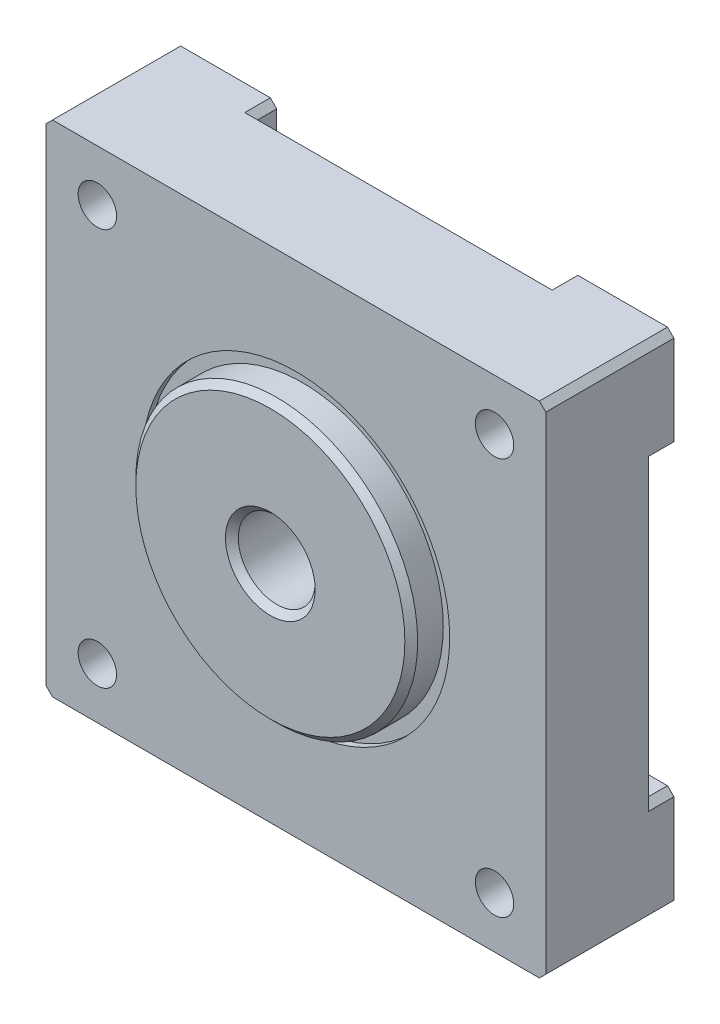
ISO-10303-21;
HEADER;
FILE_DESCRIPTION(('STEP AP214'),'2;1');
FILE_NAME('part.step','',(''),(''),'','','');
FILE_SCHEMA(('AUTOMOTIVE_DESIGN { 1 0 10303 214 1 1 1 1 }'));
ENDSEC;
DATA;
#1=APPLICATION_CONTEXT('core data for automotive mechanical design processes');
#2=APPLICATION_PROTOCOL_DEFINITION('international standard','automotive_design',2000,#1);
#3=PRODUCT_CONTEXT('',#1,'mechanical');
#4=PRODUCT('Part','Part','',(#3));
#5=PRODUCT_RELATED_PRODUCT_CATEGORY('part','',(#4));
#6=PRODUCT_DEFINITION_FORMATION('','',#4);
#7=PRODUCT_DEFINITION_CONTEXT('part definition',#1,'design');
#8=PRODUCT_DEFINITION('design','',#6,#7);
#9=PRODUCT_DEFINITION_SHAPE('','',#8);
#10=(LENGTH_UNIT() NAMED_UNIT(*) SI_UNIT(.MILLI.,.METRE.));
#11=(NAMED_UNIT(*) PLANE_ANGLE_UNIT() SI_UNIT($,.RADIAN.));
#12=(NAMED_UNIT(*) SI_UNIT($,.STERADIAN.) SOLID_ANGLE_UNIT());
#13=UNCERTAINTY_MEASURE_WITH_UNIT(LENGTH_MEASURE(1.E-05),#10,'distance_accuracy_value','');
#14=(GEOMETRIC_REPRESENTATION_CONTEXT(3) GLOBAL_UNCERTAINTY_ASSIGNED_CONTEXT((#13)) GLOBAL_UNIT_ASSIGNED_CONTEXT((#10,
#11,#12)) REPRESENTATION_CONTEXT('',''));
#15=CARTESIAN_POINT('',(0.,0.,0.));
#16=DIRECTION('',(0.,0.,1.));
#17=DIRECTION('',(1.,0.,0.));
#18=AXIS2_PLACEMENT_3D('',#15,#16,#17);
#19=CARTESIAN_POINT('',(19.,19.5,10.));
#20=DIRECTION('',(0.,-1.,0.));
#21=DIRECTION('',(1.,0.,0.));
#22=AXIS2_PLACEMENT_3D('',#19,#20,#21);
#23=PLANE('',#22);
#24=DIRECTION('',(1.,0.,0.));
#25=VECTOR('',#24,1.);
#26=CARTESIAN_POINT('',(0.,19.5,2.));
#27=LINE('',#26,#25);
#28=CARTESIAN_POINT('',(-12.,19.5,2.));
#29=VERTEX_POINT('',#28);
#30=CARTESIAN_POINT('',(12.,19.5,2.));
#31=VERTEX_POINT('',#30);
#32=EDGE_CURVE('E657',#29,#31,#27,.T.);
#33=ORIENTED_EDGE('',*,*,#32,.F.);
#34=DIRECTION('',(0.,0.,-1.));
#35=VECTOR('',#34,1.);
#36=CARTESIAN_POINT('',(-12.,19.5,10.));
#37=LINE('',#36,#35);
#38=CARTESIAN_POINT('',(-12.,19.5,0.));
#39=VERTEX_POINT('',#38);
#40=EDGE_CURVE('E345',#29,#39,#37,.T.);
#41=ORIENTED_EDGE('',*,*,#40,.T.);
#42=DIRECTION('',(-1.,0.,0.));
#43=VECTOR('',#42,1.);
#44=CARTESIAN_POINT('',(19.,19.5,0.));
#45=LINE('',#44,#43);
#46=CARTESIAN_POINT('',(-19.,19.5,0.));
#47=VERTEX_POINT('',#46);
#48=EDGE_CURVE('E269',#39,#47,#45,.T.);
#49=ORIENTED_EDGE('',*,*,#48,.T.);
#50=DIRECTION('',(0.,0.,-1.));
#51=VECTOR('',#50,1.);
#52=CARTESIAN_POINT('',(-19.,19.5,10.));
#53=LINE('',#52,#51);
#54=CARTESIAN_POINT('',(-19.,19.5,10.));
#55=VERTEX_POINT('',#54);
#56=EDGE_CURVE('E250',#55,#47,#53,.T.);
#57=ORIENTED_EDGE('',*,*,#56,.F.);
#58=DIRECTION('',(-1.,0.,0.));
#59=VECTOR('',#58,1.);
#60=CARTESIAN_POINT('',(19.,19.5,10.));
#61=LINE('',#60,#59);
#62=CARTESIAN_POINT('',(19.,19.5,10.));
#63=VERTEX_POINT('',#62);
#64=EDGE_CURVE('E256',#63,#55,#61,.T.);
#65=ORIENTED_EDGE('',*,*,#64,.F.);
#66=DIRECTION('',(0.,0.,-1.));
#67=VECTOR('',#66,1.);
#68=CARTESIAN_POINT('',(19.,19.5,10.));
#69=LINE('',#68,#67);
#70=CARTESIAN_POINT('',(19.,19.5,0.));
#71=VERTEX_POINT('',#70);
#72=EDGE_CURVE('E582',#63,#71,#69,.T.);
#73=ORIENTED_EDGE('',*,*,#72,.T.);
#74=CARTESIAN_POINT('',(12.,19.5,0.));
#75=VERTEX_POINT('',#74);
#76=EDGE_CURVE('E583',#71,#75,#45,.T.);
#77=ORIENTED_EDGE('',*,*,#76,.T.);
#78=DIRECTION('',(0.,0.,1.));
#79=VECTOR('',#78,1.);
#80=CARTESIAN_POINT('',(12.,19.5,2.));
#81=LINE('',#80,#79);
#82=EDGE_CURVE('E342',#75,#31,#81,.T.);
#83=ORIENTED_EDGE('',*,*,#82,.T.);
#84=EDGE_LOOP('',(#33,#41,#49,#57,#65,#73,#77,#83));
#85=FACE_BOUND('',#84,.T.);
#86=ADVANCED_FACE('F35',(#85),#23,.F.);
#87=CARTESIAN_POINT('',(-19.5,19.,10.));
#88=DIRECTION('',(1.,0.,0.));
#89=DIRECTION('',(0.,1.,0.));
#90=AXIS2_PLACEMENT_3D('',#87,#88,#89);
#91=PLANE('',#90);
#92=DIRECTION('',(0.,1.,0.));
#93=VECTOR('',#92,1.);
#94=CARTESIAN_POINT('',(-19.5,0.,2.));
#95=LINE('',#94,#93);
#96=CARTESIAN_POINT('',(-19.5,-12.,2.));
#97=VERTEX_POINT('',#96);
#98=CARTESIAN_POINT('',(-19.5,12.,2.));
#99=VERTEX_POINT('',#98);
#100=EDGE_CURVE('E645',#97,#99,#95,.T.);
#101=ORIENTED_EDGE('',*,*,#100,.F.);
#102=DIRECTION('',(0.,0.,-1.));
#103=VECTOR('',#102,1.);
#104=CARTESIAN_POINT('',(-19.5,-12.,10.));
#105=LINE('',#104,#103);
#106=CARTESIAN_POINT('',(-19.5,-12.,0.));
#107=VERTEX_POINT('',#106);
#108=EDGE_CURVE('E274',#97,#107,#105,.T.);
#109=ORIENTED_EDGE('',*,*,#108,.T.);
#110=DIRECTION('',(0.,-1.,0.));
#111=VECTOR('',#110,1.);
#112=CARTESIAN_POINT('',(-19.5,19.,0.));
#113=LINE('',#112,#111);
#114=CARTESIAN_POINT('',(-19.5,-19.,0.));
#115=VERTEX_POINT('',#114);
#116=EDGE_CURVE('E588',#107,#115,#113,.T.);
#117=ORIENTED_EDGE('',*,*,#116,.T.);
#118=DIRECTION('',(0.,0.,-1.));
#119=VECTOR('',#118,1.);
#120=CARTESIAN_POINT('',(-19.5,-19.,10.));
#121=LINE('',#120,#119);
#122=CARTESIAN_POINT('',(-19.5,-19.,10.));
#123=VERTEX_POINT('',#122);
#124=EDGE_CURVE('E276',#123,#115,#121,.T.);
#125=ORIENTED_EDGE('',*,*,#124,.F.);
#126=DIRECTION('',(0.,-1.,0.));
#127=VECTOR('',#126,1.);
#128=CARTESIAN_POINT('',(-19.5,19.,10.));
#129=LINE('',#128,#127);
#130=CARTESIAN_POINT('',(-19.5,19.,10.));
#131=VERTEX_POINT('',#130);
#132=EDGE_CURVE('E255',#131,#123,#129,.T.);
#133=ORIENTED_EDGE('',*,*,#132,.F.);
#134=DIRECTION('',(0.,0.,-1.));
#135=VECTOR('',#134,1.);
#136=CARTESIAN_POINT('',(-19.5,19.,10.));
#137=LINE('',#136,#135);
#138=CARTESIAN_POINT('',(-19.5,19.,0.));
#139=VERTEX_POINT('',#138);
#140=EDGE_CURVE('E252',#131,#139,#137,.T.);
#141=ORIENTED_EDGE('',*,*,#140,.T.);
#142=CARTESIAN_POINT('',(-19.5,12.,0.));
#143=VERTEX_POINT('',#142);
#144=EDGE_CURVE('E589',#139,#143,#113,.T.);
#145=ORIENTED_EDGE('',*,*,#144,.T.);
#146=DIRECTION('',(0.,0.,1.));
#147=VECTOR('',#146,1.);
#148=CARTESIAN_POINT('',(-19.5,12.,2.));
#149=LINE('',#148,#147);
#150=EDGE_CURVE('E271',#143,#99,#149,.T.);
#151=ORIENTED_EDGE('',*,*,#150,.T.);
#152=EDGE_LOOP('',(#101,#109,#117,#125,#133,#141,#145,#151));
#153=FACE_BOUND('',#152,.T.);
#154=ADVANCED_FACE('F416',(#153),#91,.F.);
#155=CARTESIAN_POINT('',(19.,-19.5,10.));
#156=DIRECTION('',(0.,1.,0.));
#157=DIRECTION('',(-1.,0.,0.));
#158=AXIS2_PLACEMENT_3D('',#155,#156,#157);
#159=PLANE('',#158);
#160=DIRECTION('',(1.,0.,0.));
#161=VECTOR('',#160,1.);
#162=CARTESIAN_POINT('',(19.,-19.5,0.));
#163=LINE('',#162,#161);
#164=CARTESIAN_POINT('',(-19.,-19.5,0.));
#165=VERTEX_POINT('',#164);
#166=CARTESIAN_POINT('',(-12.,-19.5,0.));
#167=VERTEX_POINT('',#166);
#168=EDGE_CURVE('E595',#165,#167,#163,.T.);
#169=ORIENTED_EDGE('',*,*,#168,.T.);
#170=DIRECTION('',(0.,0.,1.));
#171=VECTOR('',#170,1.);
#172=CARTESIAN_POINT('',(-12.,-19.5,2.));
#173=LINE('',#172,#171);
#174=CARTESIAN_POINT('',(-12.,-19.5,2.));
#175=VERTEX_POINT('',#174);
#176=EDGE_CURVE('E301',#167,#175,#173,.T.);
#177=ORIENTED_EDGE('',*,*,#176,.T.);
#178=DIRECTION('',(-1.,0.,0.));
#179=VECTOR('',#178,1.);
#180=CARTESIAN_POINT('',(0.,-19.5,2.));
#181=LINE('',#180,#179);
#182=CARTESIAN_POINT('',(12.,-19.5,2.));
#183=VERTEX_POINT('',#182);
#184=EDGE_CURVE('E637',#183,#175,#181,.T.);
#185=ORIENTED_EDGE('',*,*,#184,.F.);
#186=DIRECTION('',(0.,0.,-1.));
#187=VECTOR('',#186,1.);
#188=CARTESIAN_POINT('',(12.,-19.5,10.));
#189=LINE('',#188,#187);
#190=CARTESIAN_POINT('',(12.,-19.5,0.));
#191=VERTEX_POINT('',#190);
#192=EDGE_CURVE('E298',#183,#191,#189,.T.);
#193=ORIENTED_EDGE('',*,*,#192,.T.);
#194=CARTESIAN_POINT('',(19.,-19.5,0.));
#195=VERTEX_POINT('',#194);
#196=EDGE_CURVE('E594',#191,#195,#163,.T.);
#197=ORIENTED_EDGE('',*,*,#196,.T.);
#198=DIRECTION('',(0.,0.,-1.));
#199=VECTOR('',#198,1.);
#200=CARTESIAN_POINT('',(19.,-19.5,10.));
#201=LINE('',#200,#199);
#202=CARTESIAN_POINT('',(19.,-19.5,10.));
#203=VERTEX_POINT('',#202);
#204=EDGE_CURVE('E612',#203,#195,#201,.T.);
#205=ORIENTED_EDGE('',*,*,#204,.F.);
#206=DIRECTION('',(1.,0.,0.));
#207=VECTOR('',#206,1.);
#208=CARTESIAN_POINT('',(19.,-19.5,10.));
#209=LINE('',#208,#207);
#210=CARTESIAN_POINT('',(-19.,-19.5,10.));
#211=VERTEX_POINT('',#210);
#212=EDGE_CURVE('E575',#211,#203,#209,.T.);
#213=ORIENTED_EDGE('',*,*,#212,.F.);
#214=DIRECTION('',(0.,0.,-1.));
#215=VECTOR('',#214,1.);
#216=CARTESIAN_POINT('',(-19.,-19.5,10.));
#217=LINE('',#216,#215);
#218=EDGE_CURVE('E615',#211,#165,#217,.T.);
#219=ORIENTED_EDGE('',*,*,#218,.T.);
#220=EDGE_LOOP('',(#169,#177,#185,#193,#197,#205,#213,#219));
#221=FACE_BOUND('',#220,.T.);
#222=ADVANCED_FACE('F421',(#221),#159,.F.);
#223=CARTESIAN_POINT('',(19.5,19.,10.));
#224=DIRECTION('',(-1.,0.,0.));
#225=DIRECTION('',(0.,0.,1.));
#226=AXIS2_PLACEMENT_3D('',#223,#224,#225);
#227=PLANE('',#226);
#228=DIRECTION('',(0.,1.,0.));
#229=VECTOR('',#228,1.);
#230=CARTESIAN_POINT('',(19.5,19.,0.));
#231=LINE('',#230,#229);
#232=CARTESIAN_POINT('',(19.5,-19.,0.));
#233=VERTEX_POINT('',#232);
#234=CARTESIAN_POINT('',(19.5,-12.,0.));
#235=VERTEX_POINT('',#234);
#236=EDGE_CURVE('E601',#233,#235,#231,.T.);
#237=ORIENTED_EDGE('',*,*,#236,.T.);
#238=DIRECTION('',(0.,0.,1.));
#239=VECTOR('',#238,1.);
#240=CARTESIAN_POINT('',(19.5,-12.,2.));
#241=LINE('',#240,#239);
#242=CARTESIAN_POINT('',(19.5,-12.,2.));
#243=VERTEX_POINT('',#242);
#244=EDGE_CURVE('E323',#235,#243,#241,.T.);
#245=ORIENTED_EDGE('',*,*,#244,.T.);
#246=DIRECTION('',(0.,-1.,0.));
#247=VECTOR('',#246,1.);
#248=CARTESIAN_POINT('',(19.5,0.,2.));
#249=LINE('',#248,#247);
#250=CARTESIAN_POINT('',(19.5,12.,2.));
#251=VERTEX_POINT('',#250);
#252=EDGE_CURVE('E545',#251,#243,#249,.T.);
#253=ORIENTED_EDGE('',*,*,#252,.F.);
#254=DIRECTION('',(0.,0.,-1.));
#255=VECTOR('',#254,1.);
#256=CARTESIAN_POINT('',(19.5,12.,10.));
#257=LINE('',#256,#255);
#258=CARTESIAN_POINT('',(19.5,12.,0.));
#259=VERTEX_POINT('',#258);
#260=EDGE_CURVE('E320',#251,#259,#257,.T.);
#261=ORIENTED_EDGE('',*,*,#260,.T.);
#262=CARTESIAN_POINT('',(19.5,19.,0.));
#263=VERTEX_POINT('',#262);
#264=EDGE_CURVE('E600',#259,#263,#231,.T.);
#265=ORIENTED_EDGE('',*,*,#264,.T.);
#266=DIRECTION('',(0.,0.,-1.));
#267=VECTOR('',#266,1.);
#268=CARTESIAN_POINT('',(19.5,19.,10.));
#269=LINE('',#268,#267);
#270=CARTESIAN_POINT('',(19.5,19.,10.));
#271=VERTEX_POINT('',#270);
#272=EDGE_CURVE('E606',#271,#263,#269,.T.);
#273=ORIENTED_EDGE('',*,*,#272,.F.);
#274=DIRECTION('',(0.,1.,0.));
#275=VECTOR('',#274,1.);
#276=CARTESIAN_POINT('',(19.5,19.,10.));
#277=LINE('',#276,#275);
#278=CARTESIAN_POINT('',(19.5,-19.,10.));
#279=VERTEX_POINT('',#278);
#280=EDGE_CURVE('E579',#279,#271,#277,.T.);
#281=ORIENTED_EDGE('',*,*,#280,.F.);
#282=DIRECTION('',(0.,0.,-1.));
#283=VECTOR('',#282,1.);
#284=CARTESIAN_POINT('',(19.5,-19.,10.));
#285=LINE('',#284,#283);
#286=EDGE_CURVE('E609',#279,#233,#285,.T.);
#287=ORIENTED_EDGE('',*,*,#286,.T.);
#288=EDGE_LOOP('',(#237,#245,#253,#261,#265,#273,#281,#287));
#289=FACE_BOUND('',#288,.T.);
#290=ADVANCED_FACE('F667',(#289),#227,.F.);
#291=CARTESIAN_POINT('',(0.,0.,0.));
#292=DIRECTION('',(0.,0.,1.));
#293=DIRECTION('',(1.,0.,0.));
#294=AXIS2_PLACEMENT_3D('',#291,#292,#293);
#295=PLANE('',#294);
#296=CARTESIAN_POINT('',(15.5,15.5,0.));
#297=DIRECTION('',(0.,0.,1.));
#298=DIRECTION('',(-1.,0.,0.));
#299=AXIS2_PLACEMENT_3D('',#296,#297,#298);
#300=CIRCLE('',#299,1.49999999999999);
#301=CARTESIAN_POINT('',(14.,15.5,0.));
#302=VERTEX_POINT('',#301);
#303=EDGE_CURVE('E552',#302,#302,#300,.T.);
#304=ORIENTED_EDGE('',*,*,#303,.T.);
#305=EDGE_LOOP('',(#304));
#306=FACE_BOUND('',#305,.T.);
#307=DIRECTION('',(0.,1.,0.));
#308=VECTOR('',#307,1.);
#309=CARTESIAN_POINT('',(11.5,0.,0.));
#310=LINE('',#309,#308);
#311=CARTESIAN_POINT('',(11.5,12.,0.));
#312=VERTEX_POINT('',#311);
#313=CARTESIAN_POINT('',(11.5,19.,0.));
#314=VERTEX_POINT('',#313);
#315=EDGE_CURVE('E534',#312,#314,#310,.T.);
#316=ORIENTED_EDGE('',*,*,#315,.T.);
#317=DIRECTION('',(0.707106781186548,0.707106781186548,0.));
#318=VECTOR('',#317,1.);
#319=CARTESIAN_POINT('',(11.5,19.,0.));
#320=LINE('',#319,#318);
#321=EDGE_CURVE('E356',#314,#75,#320,.T.);
#322=ORIENTED_EDGE('',*,*,#321,.T.);
#323=ORIENTED_EDGE('',*,*,#76,.F.);
#324=DIRECTION('',(-0.707106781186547,0.707106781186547,0.));
#325=VECTOR('',#324,1.);
#326=CARTESIAN_POINT('',(19.5,19.,0.));
#327=LINE('',#326,#325);
#328=EDGE_CURVE('E265',#263,#71,#327,.T.);
#329=ORIENTED_EDGE('',*,*,#328,.F.);
#330=ORIENTED_EDGE('',*,*,#264,.F.);
#331=DIRECTION('',(0.707106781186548,0.707106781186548,0.));
#332=VECTOR('',#331,1.);
#333=CARTESIAN_POINT('',(19.5,12.,0.));
#334=LINE('',#333,#332);
#335=CARTESIAN_POINT('',(19.,11.5,0.));
#336=VERTEX_POINT('',#335);
#337=EDGE_CURVE('E354',#259,#336,#334,.F.);
#338=ORIENTED_EDGE('',*,*,#337,.T.);
#339=DIRECTION('',(1.,0.,0.));
#340=VECTOR('',#339,1.);
#341=CARTESIAN_POINT('',(0.,11.5,0.));
#342=LINE('',#341,#340);
#343=CARTESIAN_POINT('',(12.,11.5,0.));
#344=VERTEX_POINT('',#343);
#345=EDGE_CURVE('E503',#344,#336,#342,.T.);
#346=ORIENTED_EDGE('',*,*,#345,.F.);
#347=DIRECTION('',(-0.707106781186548,0.707106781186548,0.));
#348=VECTOR('',#347,1.);
#349=CARTESIAN_POINT('',(12.,11.5,0.));
#350=LINE('',#349,#348);
#351=EDGE_CURVE('E352',#344,#312,#350,.T.);
#352=ORIENTED_EDGE('',*,*,#351,.T.);
#353=EDGE_LOOP('',(#316,#322,#323,#329,#330,#338,#346,#352));
#354=FACE_BOUND('',#353,.T.);
#355=ADVANCED_FACE('F709',(#306,#354),#295,.F.);
#356=CARTESIAN_POINT('',(-15.5,15.5,0.));
#357=DIRECTION('',(0.,0.,1.));
#358=DIRECTION('',(1.,0.,0.));
#359=AXIS2_PLACEMENT_3D('',#356,#357,#358);
#360=CIRCLE('',#359,1.5);
#361=CARTESIAN_POINT('',(-14.,15.5,0.));
#362=VERTEX_POINT('',#361);
#363=EDGE_CURVE('E558',#362,#362,#360,.T.);
#364=ORIENTED_EDGE('',*,*,#363,.T.);
#365=EDGE_LOOP('',(#364));
#366=FACE_BOUND('',#365,.T.);
#367=DIRECTION('',(-1.,0.,0.));
#368=VECTOR('',#367,1.);
#369=CARTESIAN_POINT('',(0.,11.5,0.));
#370=LINE('',#369,#368);
#371=CARTESIAN_POINT('',(-12.,11.5,0.));
#372=VERTEX_POINT('',#371);
#373=CARTESIAN_POINT('',(-19.,11.5,0.));
#374=VERTEX_POINT('',#373);
#375=EDGE_CURVE('E528',#372,#374,#370,.T.);
#376=ORIENTED_EDGE('',*,*,#375,.T.);
#377=DIRECTION('',(-0.707106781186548,0.707106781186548,0.));
#378=VECTOR('',#377,1.);
#379=CARTESIAN_POINT('',(-19.,11.5,0.));
#380=LINE('',#379,#378);
#381=EDGE_CURVE('E335',#374,#143,#380,.T.);
#382=ORIENTED_EDGE('',*,*,#381,.T.);
#383=ORIENTED_EDGE('',*,*,#144,.F.);
#384=DIRECTION('',(-0.707106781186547,-0.707106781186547,0.));
#385=VECTOR('',#384,1.);
#386=CARTESIAN_POINT('',(-19.,19.5,0.));
#387=LINE('',#386,#385);
#388=EDGE_CURVE('E586',#47,#139,#387,.T.);
#389=ORIENTED_EDGE('',*,*,#388,.F.);
#390=ORIENTED_EDGE('',*,*,#48,.F.);
#391=DIRECTION('',(-0.707106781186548,0.707106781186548,0.));
#392=VECTOR('',#391,1.);
#393=CARTESIAN_POINT('',(-12.,19.5,0.));
#394=LINE('',#393,#392);
#395=CARTESIAN_POINT('',(-11.5,19.,0.));
#396=VERTEX_POINT('',#395);
#397=EDGE_CURVE('E331',#39,#396,#394,.F.);
#398=ORIENTED_EDGE('',*,*,#397,.T.);
#399=DIRECTION('',(0.,1.,0.));
#400=VECTOR('',#399,1.);
#401=CARTESIAN_POINT('',(-11.5,0.,0.));
#402=LINE('',#401,#400);
#403=CARTESIAN_POINT('',(-11.5,12.,0.));
#404=VERTEX_POINT('',#403);
#405=EDGE_CURVE('E531',#404,#396,#402,.T.);
#406=ORIENTED_EDGE('',*,*,#405,.F.);
#407=DIRECTION('',(-0.707106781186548,-0.707106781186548,0.));
#408=VECTOR('',#407,1.);
#409=CARTESIAN_POINT('',(-11.5,12.,0.));
#410=LINE('',#409,#408);
#411=EDGE_CURVE('E333',#404,#372,#410,.T.);
#412=ORIENTED_EDGE('',*,*,#411,.T.);
#413=EDGE_LOOP('',(#376,#382,#383,#389,#390,#398,#406,#412));
#414=FACE_BOUND('',#413,.T.);
#415=ADVANCED_FACE('F683',(#366,#414),#295,.F.);
#416=CARTESIAN_POINT('',(15.5,-15.5,0.));
#417=DIRECTION('',(0.,0.,1.));
#418=DIRECTION('',(1.,0.,0.));
#419=AXIS2_PLACEMENT_3D('',#416,#417,#418);
#420=CIRCLE('',#419,1.49999999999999);
#421=CARTESIAN_POINT('',(17.,-15.5,0.));
#422=VERTEX_POINT('',#421);
#423=EDGE_CURVE('E546',#422,#422,#420,.T.);
#424=ORIENTED_EDGE('',*,*,#423,.T.);
#425=EDGE_LOOP('',(#424));
#426=FACE_BOUND('',#425,.T.);
#427=ORIENTED_EDGE('',*,*,#196,.F.);
#428=DIRECTION('',(0.707106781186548,-0.707106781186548,0.));
#429=VECTOR('',#428,1.);
#430=CARTESIAN_POINT('',(12.,-19.5,0.));
#431=LINE('',#430,#429);
#432=CARTESIAN_POINT('',(11.5,-19.,0.));
#433=VERTEX_POINT('',#432);
#434=EDGE_CURVE('E308',#191,#433,#431,.F.);
#435=ORIENTED_EDGE('',*,*,#434,.T.);
#436=DIRECTION('',(0.,-1.,0.));
#437=VECTOR('',#436,1.);
#438=CARTESIAN_POINT('',(11.5,0.,0.));
#439=LINE('',#438,#437);
#440=CARTESIAN_POINT('',(11.5,-12.,0.));
#441=VERTEX_POINT('',#440);
#442=EDGE_CURVE('E510',#441,#433,#439,.T.);
#443=ORIENTED_EDGE('',*,*,#442,.F.);
#444=DIRECTION('',(0.707106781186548,0.707106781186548,0.));
#445=VECTOR('',#444,1.);
#446=CARTESIAN_POINT('',(11.5,-12.,0.));
#447=LINE('',#446,#445);
#448=CARTESIAN_POINT('',(12.,-11.5,0.));
#449=VERTEX_POINT('',#448);
#450=EDGE_CURVE('E306',#441,#449,#447,.T.);
#451=ORIENTED_EDGE('',*,*,#450,.T.);
#452=DIRECTION('',(1.,0.,0.));
#453=VECTOR('',#452,1.);
#454=CARTESIAN_POINT('',(0.,-11.5,0.));
#455=LINE('',#454,#453);
#456=CARTESIAN_POINT('',(19.,-11.5,0.));
#457=VERTEX_POINT('',#456);
#458=EDGE_CURVE('E518',#449,#457,#455,.T.);
#459=ORIENTED_EDGE('',*,*,#458,.T.);
#460=DIRECTION('',(0.707106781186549,-0.707106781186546,0.));
#461=VECTOR('',#460,1.);
#462=CARTESIAN_POINT('',(19.,-11.5,0.));
#463=LINE('',#462,#461);
#464=EDGE_CURVE('E304',#457,#235,#463,.T.);
#465=ORIENTED_EDGE('',*,*,#464,.T.);
#466=ORIENTED_EDGE('',*,*,#236,.F.);
#467=DIRECTION('',(0.707106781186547,0.707106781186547,0.));
#468=VECTOR('',#467,1.);
#469=CARTESIAN_POINT('',(19.5,-19.,0.));
#470=LINE('',#469,#468);
#471=EDGE_CURVE('E598',#195,#233,#470,.T.);
#472=ORIENTED_EDGE('',*,*,#471,.F.);
#473=EDGE_LOOP('',(#427,#435,#443,#451,#459,#465,#466,#472));
#474=FACE_BOUND('',#473,.T.);
#475=ADVANCED_FACE('F514',(#426,#474),#295,.F.);
#476=CARTESIAN_POINT('',(0.,0.,10.));
#477=DIRECTION('',(0.,0.,1.));
#478=DIRECTION('',(1.,0.,0.));
#479=AXIS2_PLACEMENT_3D('',#476,#477,#478);
#480=PLANE('',#479);
#481=CARTESIAN_POINT('',(-15.5,-15.5,10.));
#482=DIRECTION('',(0.,0.,1.));
#483=DIRECTION('',(-1.,0.,0.));
#484=AXIS2_PLACEMENT_3D('',#481,#482,#483);
#485=CIRCLE('',#484,1.5);
#486=CARTESIAN_POINT('',(-17.,-15.5,10.));
#487=VERTEX_POINT('',#486);
#488=EDGE_CURVE('E542',#487,#487,#485,.T.);
#489=ORIENTED_EDGE('',*,*,#488,.F.);
#490=EDGE_LOOP('',(#489));
#491=FACE_BOUND('',#490,.T.);
#492=CARTESIAN_POINT('',(15.5,-15.5,10.));
#493=DIRECTION('',(0.,0.,1.));
#494=DIRECTION('',(1.,0.,0.));
#495=AXIS2_PLACEMENT_3D('',#492,#493,#494);
#496=CIRCLE('',#495,1.49999999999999);
#497=CARTESIAN_POINT('',(17.,-15.5,10.));
#498=VERTEX_POINT('',#497);
#499=EDGE_CURVE('E541',#498,#498,#496,.T.);
#500=ORIENTED_EDGE('',*,*,#499,.F.);
#501=EDGE_LOOP('',(#500));
#502=FACE_BOUND('',#501,.T.);
#503=CARTESIAN_POINT('',(15.5,15.5,10.));
#504=DIRECTION('',(0.,0.,1.));
#505=DIRECTION('',(-1.,0.,0.));
#506=AXIS2_PLACEMENT_3D('',#503,#504,#505);
#507=CIRCLE('',#506,1.49999999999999);
#508=CARTESIAN_POINT('',(14.,15.5,10.));
#509=VERTEX_POINT('',#508);
#510=EDGE_CURVE('E549',#509,#509,#507,.T.);
#511=ORIENTED_EDGE('',*,*,#510,.F.);
#512=EDGE_LOOP('',(#511));
#513=FACE_BOUND('',#512,.T.);
#514=CARTESIAN_POINT('',(-15.5,15.5,10.));
#515=DIRECTION('',(0.,0.,1.));
#516=DIRECTION('',(1.,0.,0.));
#517=AXIS2_PLACEMENT_3D('',#514,#515,#516);
#518=CIRCLE('',#517,1.5);
#519=CARTESIAN_POINT('',(-14.,15.5,10.));
#520=VERTEX_POINT('',#519);
#521=EDGE_CURVE('E555',#520,#520,#518,.T.);
#522=ORIENTED_EDGE('',*,*,#521,.F.);
#523=EDGE_LOOP('',(#522));
#524=FACE_BOUND('',#523,.T.);
#525=CARTESIAN_POINT('',(0.,0.,10.));
#526=DIRECTION('',(0.,0.,1.));
#527=DIRECTION('',(1.,0.,0.));
#528=AXIS2_PLACEMENT_3D('',#525,#526,#527);
#529=CIRCLE('',#528,12.);
#530=CARTESIAN_POINT('',(12.,0.,10.));
#531=VERTEX_POINT('',#530);
#532=EDGE_CURVE('E566',#531,#531,#529,.T.);
#533=ORIENTED_EDGE('',*,*,#532,.F.);
#534=EDGE_LOOP('',(#533));
#535=FACE_BOUND('',#534,.T.);
#536=ORIENTED_EDGE('',*,*,#64,.T.);
#537=DIRECTION('',(-0.707106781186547,-0.707106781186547,0.));
#538=VECTOR('',#537,1.);
#539=CARTESIAN_POINT('',(-19.,19.5,10.));
#540=LINE('',#539,#538);
#541=EDGE_CURVE('E246',#55,#131,#540,.T.);
#542=ORIENTED_EDGE('',*,*,#541,.T.);
#543=ORIENTED_EDGE('',*,*,#132,.T.);
#544=DIRECTION('',(0.707106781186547,-0.707106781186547,0.));
#545=VECTOR('',#544,1.);
#546=CARTESIAN_POINT('',(-19.5,-19.,10.));
#547=LINE('',#546,#545);
#548=EDGE_CURVE('E573',#123,#211,#547,.T.);
#549=ORIENTED_EDGE('',*,*,#548,.T.);
#550=ORIENTED_EDGE('',*,*,#212,.T.);
#551=DIRECTION('',(0.707106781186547,0.707106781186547,0.));
#552=VECTOR('',#551,1.);
#553=CARTESIAN_POINT('',(19.5,-19.,10.));
#554=LINE('',#553,#552);
#555=EDGE_CURVE('E577',#203,#279,#554,.T.);
#556=ORIENTED_EDGE('',*,*,#555,.T.);
#557=ORIENTED_EDGE('',*,*,#280,.T.);
#558=DIRECTION('',(-0.707106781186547,0.707106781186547,0.));
#559=VECTOR('',#558,1.);
#560=CARTESIAN_POINT('',(19.5,19.,10.));
#561=LINE('',#560,#559);
#562=EDGE_CURVE('E261',#271,#63,#561,.T.);
#563=ORIENTED_EDGE('',*,*,#562,.T.);
#564=EDGE_LOOP('',(#536,#542,#543,#549,#550,#556,#557,#563));
#565=FACE_BOUND('',#564,.T.);
#566=ADVANCED_FACE('F259',(#491,#502,#513,#524,#535,#565),#480,.T.);
#567=CARTESIAN_POINT('',(-19.,19.5,10.));
#568=DIRECTION('',(0.707106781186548,-0.707106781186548,0.));
#569=DIRECTION('',(0.707106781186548,0.707106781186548,0.));
#570=AXIS2_PLACEMENT_3D('',#567,#568,#569);
#571=PLANE('',#570);
#572=ORIENTED_EDGE('',*,*,#388,.T.);
#573=ORIENTED_EDGE('',*,*,#140,.F.);
#574=ORIENTED_EDGE('',*,*,#541,.F.);
#575=ORIENTED_EDGE('',*,*,#56,.T.);
#576=EDGE_LOOP('',(#572,#573,#574,#575));
#577=FACE_BOUND('',#576,.T.);
#578=ADVANCED_FACE('F248',(#577),#571,.F.);
#579=CARTESIAN_POINT('',(-19.5,-19.,10.));
#580=DIRECTION('',(0.707106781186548,0.707106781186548,0.));
#581=DIRECTION('',(-0.707106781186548,0.707106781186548,0.));
#582=AXIS2_PLACEMENT_3D('',#579,#580,#581);
#583=PLANE('',#582);
#584=DIRECTION('',(0.707106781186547,-0.707106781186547,0.));
#585=VECTOR('',#584,1.);
#586=CARTESIAN_POINT('',(-19.5,-19.,0.));
#587=LINE('',#586,#585);
#588=EDGE_CURVE('E592',#115,#165,#587,.T.);
#589=ORIENTED_EDGE('',*,*,#588,.T.);
#590=ORIENTED_EDGE('',*,*,#218,.F.);
#591=ORIENTED_EDGE('',*,*,#548,.F.);
#592=ORIENTED_EDGE('',*,*,#124,.T.);
#593=EDGE_LOOP('',(#589,#590,#591,#592));
#594=FACE_BOUND('',#593,.T.);
#595=ADVANCED_FACE('F622',(#594),#583,.F.);
#596=CARTESIAN_POINT('',(19.5,-19.,10.));
#597=DIRECTION('',(-0.707106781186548,0.707106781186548,0.));
#598=DIRECTION('',(-0.707106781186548,-0.707106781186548,0.));
#599=AXIS2_PLACEMENT_3D('',#596,#597,#598);
#600=PLANE('',#599);
#601=ORIENTED_EDGE('',*,*,#471,.T.);
#602=ORIENTED_EDGE('',*,*,#286,.F.);
#603=ORIENTED_EDGE('',*,*,#555,.F.);
#604=ORIENTED_EDGE('',*,*,#204,.T.);
#605=EDGE_LOOP('',(#601,#602,#603,#604));
#606=FACE_BOUND('',#605,.T.);
#607=ADVANCED_FACE('F673',(#606),#600,.F.);
#608=CARTESIAN_POINT('',(19.5,19.,10.));
#609=DIRECTION('',(-0.707106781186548,-0.707106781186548,0.));
#610=DIRECTION('',(0.707106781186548,-0.707106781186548,0.));
#611=AXIS2_PLACEMENT_3D('',#608,#609,#610);
#612=PLANE('',#611);
#613=ORIENTED_EDGE('',*,*,#328,.T.);
#614=ORIENTED_EDGE('',*,*,#72,.F.);
#615=ORIENTED_EDGE('',*,*,#562,.F.);
#616=ORIENTED_EDGE('',*,*,#272,.T.);
#617=EDGE_LOOP('',(#613,#614,#615,#616));
#618=FACE_BOUND('',#617,.T.);
#619=ADVANCED_FACE('F712',(#618),#612,.F.);
#620=CARTESIAN_POINT('',(-15.5,-15.5,0.));
#621=DIRECTION('',(0.,0.,1.));
#622=DIRECTION('',(-1.,0.,0.));
#623=AXIS2_PLACEMENT_3D('',#620,#621,#622);
#624=CIRCLE('',#623,1.5);
#625=CARTESIAN_POINT('',(-17.,-15.5,0.));
#626=VERTEX_POINT('',#625);
#627=EDGE_CURVE('E538',#626,#626,#624,.T.);
#628=ORIENTED_EDGE('',*,*,#627,.T.);
#629=EDGE_LOOP('',(#628));
#630=FACE_BOUND('',#629,.T.);
#631=ORIENTED_EDGE('',*,*,#116,.F.);
#632=DIRECTION('',(-0.707106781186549,-0.707106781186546,0.));
#633=VECTOR('',#632,1.);
#634=CARTESIAN_POINT('',(-19.5,-12.,0.));
#635=LINE('',#634,#633);
#636=CARTESIAN_POINT('',(-19.,-11.5,0.));
#637=VERTEX_POINT('',#636);
#638=EDGE_CURVE('E286',#107,#637,#635,.F.);
#639=ORIENTED_EDGE('',*,*,#638,.T.);
#640=DIRECTION('',(-1.,0.,0.));
#641=VECTOR('',#640,1.);
#642=CARTESIAN_POINT('',(0.,-11.5,0.));
#643=LINE('',#642,#641);
#644=CARTESIAN_POINT('',(-12.,-11.5,0.));
#645=VERTEX_POINT('',#644);
#646=EDGE_CURVE('E521',#645,#637,#643,.T.);
#647=ORIENTED_EDGE('',*,*,#646,.F.);
#648=DIRECTION('',(0.707106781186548,-0.707106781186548,0.));
#649=VECTOR('',#648,1.);
#650=CARTESIAN_POINT('',(-12.,-11.5,0.));
#651=LINE('',#650,#649);
#652=CARTESIAN_POINT('',(-11.5,-12.,0.));
#653=VERTEX_POINT('',#652);
#654=EDGE_CURVE('E284',#645,#653,#651,.T.);
#655=ORIENTED_EDGE('',*,*,#654,.T.);
#656=DIRECTION('',(0.,-1.,0.));
#657=VECTOR('',#656,1.);
#658=CARTESIAN_POINT('',(-11.5,0.,0.));
#659=LINE('',#658,#657);
#660=CARTESIAN_POINT('',(-11.5,-19.,0.));
#661=VERTEX_POINT('',#660);
#662=EDGE_CURVE('E517',#653,#661,#659,.T.);
#663=ORIENTED_EDGE('',*,*,#662,.T.);
#664=DIRECTION('',(-0.707106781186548,-0.707106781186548,0.));
#665=VECTOR('',#664,1.);
#666=CARTESIAN_POINT('',(-11.5,-19.,0.));
#667=LINE('',#666,#665);
#668=EDGE_CURVE('E282',#661,#167,#667,.T.);
#669=ORIENTED_EDGE('',*,*,#668,.T.);
#670=ORIENTED_EDGE('',*,*,#168,.F.);
#671=ORIENTED_EDGE('',*,*,#588,.F.);
#672=EDGE_LOOP('',(#631,#639,#647,#655,#663,#669,#670,#671));
#673=FACE_BOUND('',#672,.T.);
#674=ADVANCED_FACE('F627',(#630,#673),#295,.F.);
#675=CARTESIAN_POINT('',(0.,0.,9.5));
#676=DIRECTION('',(0.,0.,1.));
#677=DIRECTION('',(1.,0.,0.));
#678=AXIS2_PLACEMENT_3D('',#675,#676,#677);
#679=CYLINDRICAL_SURFACE('',#678,12.);
#680=CARTESIAN_POINT('',(0.,0.,9.5));
#681=DIRECTION('',(0.,0.,1.));
#682=DIRECTION('',(1.,0.,0.));
#683=AXIS2_PLACEMENT_3D('',#680,#681,#682);
#684=CIRCLE('',#683,12.);
#685=CARTESIAN_POINT('',(12.,0.,9.5));
#686=VERTEX_POINT('',#685);
#687=EDGE_CURVE('E567',#686,#686,#684,.T.);
#688=ORIENTED_EDGE('',*,*,#687,.F.);
#689=EDGE_LOOP('',(#688));
#690=FACE_BOUND('',#689,.T.);
#691=ORIENTED_EDGE('',*,*,#532,.T.);
#692=EDGE_LOOP('',(#691));
#693=FACE_BOUND('',#692,.T.);
#694=ADVANCED_FACE('F758',(#690,#693),#679,.F.);
#695=CARTESIAN_POINT('',(0.,0.,9.5));
#696=DIRECTION('',(0.,0.,1.));
#697=DIRECTION('',(1.,0.,0.));
#698=AXIS2_PLACEMENT_3D('',#695,#696,#697);
#699=PLANE('',#698);
#700=CARTESIAN_POINT('',(0.,0.,9.5));
#701=DIRECTION('',(0.,0.,1.));
#702=DIRECTION('',(1.,0.,0.));
#703=AXIS2_PLACEMENT_3D('',#700,#701,#702);
#704=CIRCLE('',#703,11.);
#705=CARTESIAN_POINT('',(11.,0.,9.5));
#706=VERTEX_POINT('',#705);
#707=EDGE_CURVE('E561',#706,#706,#704,.T.);
#708=ORIENTED_EDGE('',*,*,#707,.F.);
#709=EDGE_LOOP('',(#708));
#710=FACE_BOUND('',#709,.T.);
#711=ORIENTED_EDGE('',*,*,#687,.T.);
#712=EDGE_LOOP('',(#711));
#713=FACE_BOUND('',#712,.T.);
#714=ADVANCED_FACE('F755',(#710,#713),#699,.T.);
#715=CARTESIAN_POINT('',(0.,0.,12.));
#716=DIRECTION('',(0.,0.,1.));
#717=DIRECTION('',(1.,0.,0.));
#718=AXIS2_PLACEMENT_3D('',#715,#716,#717);
#719=PLANE('',#718);
#720=CARTESIAN_POINT('',(0.,0.,12.));
#721=DIRECTION('',(0.,0.,1.));
#722=DIRECTION('',(1.,0.,0.));
#723=AXIS2_PLACEMENT_3D('',#720,#721,#722);
#724=CIRCLE('',#723,10.5);
#725=CARTESIAN_POINT('',(10.5,0.,12.));
#726=VERTEX_POINT('',#725);
#727=EDGE_CURVE('E43',#726,#726,#724,.T.);
#728=ORIENTED_EDGE('',*,*,#727,.T.);
#729=EDGE_LOOP('',(#728));
#730=FACE_BOUND('',#729,.T.);
#731=CARTESIAN_POINT('',(0.,0.,12.));
#732=DIRECTION('',(0.,0.,1.));
#733=DIRECTION('',(1.,0.,0.));
#734=AXIS2_PLACEMENT_3D('',#731,#732,#733);
#735=CIRCLE('',#734,3.50000000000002);
#736=CARTESIAN_POINT('',(3.50000000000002,0.,12.));
#737=VERTEX_POINT('',#736);
#738=EDGE_CURVE('E398',#737,#737,#735,.F.);
#739=ORIENTED_EDGE('',*,*,#738,.T.);
#740=EDGE_LOOP('',(#739));
#741=FACE_BOUND('',#740,.T.);
#742=ADVANCED_FACE('F403',(#730,#741),#719,.T.);
#743=CARTESIAN_POINT('',(0.,0.,12.));
#744=DIRECTION('',(0.,0.,-1.));
#745=DIRECTION('',(-1.,0.,0.));
#746=AXIS2_PLACEMENT_3D('',#743,#744,#745);
#747=CYLINDRICAL_SURFACE('',#746,11.);
#748=CARTESIAN_POINT('',(0.,0.,11.5));
#749=DIRECTION('',(0.,0.,1.));
#750=DIRECTION('',(1.,0.,0.));
#751=AXIS2_PLACEMENT_3D('',#748,#749,#750);
#752=CIRCLE('',#751,11.);
#753=CARTESIAN_POINT('',(11.,0.,11.5));
#754=VERTEX_POINT('',#753);
#755=EDGE_CURVE('E11',#754,#754,#752,.F.);
#756=ORIENTED_EDGE('',*,*,#755,.T.);
#757=EDGE_LOOP('',(#756));
#758=FACE_BOUND('',#757,.T.);
#759=ORIENTED_EDGE('',*,*,#707,.T.);
#760=EDGE_LOOP('',(#759));
#761=FACE_BOUND('',#760,.T.);
#762=ADVANCED_FACE('F753',(#758,#761),#747,.T.);
#763=CARTESIAN_POINT('',(-15.5,15.5,0.));
#764=DIRECTION('',(0.,0.,1.));
#765=DIRECTION('',(1.,0.,0.));
#766=AXIS2_PLACEMENT_3D('',#763,#764,#765);
#767=CYLINDRICAL_SURFACE('',#766,1.5);
#768=ORIENTED_EDGE('',*,*,#363,.F.);
#769=EDGE_LOOP('',(#768));
#770=FACE_BOUND('',#769,.T.);
#771=ORIENTED_EDGE('',*,*,#521,.T.);
#772=EDGE_LOOP('',(#771));
#773=FACE_BOUND('',#772,.T.);
#774=ADVANCED_FACE('F749',(#770,#773),#767,.F.);
#775=CARTESIAN_POINT('',(15.5,15.5,0.));
#776=DIRECTION('',(0.,0.,1.));
#777=DIRECTION('',(1.,0.,0.));
#778=AXIS2_PLACEMENT_3D('',#775,#776,#777);
#779=CYLINDRICAL_SURFACE('',#778,1.49999999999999);
#780=ORIENTED_EDGE('',*,*,#303,.F.);
#781=EDGE_LOOP('',(#780));
#782=FACE_BOUND('',#781,.T.);
#783=ORIENTED_EDGE('',*,*,#510,.T.);
#784=EDGE_LOOP('',(#783));
#785=FACE_BOUND('',#784,.T.);
#786=ADVANCED_FACE('F745',(#782,#785),#779,.F.);
#787=CARTESIAN_POINT('',(15.5,-15.5,0.));
#788=DIRECTION('',(0.,0.,1.));
#789=DIRECTION('',(1.,0.,0.));
#790=AXIS2_PLACEMENT_3D('',#787,#788,#789);
#791=CYLINDRICAL_SURFACE('',#790,1.49999999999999);
#792=ORIENTED_EDGE('',*,*,#423,.F.);
#793=EDGE_LOOP('',(#792));
#794=FACE_BOUND('',#793,.T.);
#795=ORIENTED_EDGE('',*,*,#499,.T.);
#796=EDGE_LOOP('',(#795));
#797=FACE_BOUND('',#796,.T.);
#798=ADVANCED_FACE('F741',(#794,#797),#791,.F.);
#799=CARTESIAN_POINT('',(-15.5,-15.5,0.));
#800=DIRECTION('',(0.,0.,1.));
#801=DIRECTION('',(1.,0.,0.));
#802=AXIS2_PLACEMENT_3D('',#799,#800,#801);
#803=CYLINDRICAL_SURFACE('',#802,1.5);
#804=ORIENTED_EDGE('',*,*,#627,.F.);
#805=EDGE_LOOP('',(#804));
#806=FACE_BOUND('',#805,.T.);
#807=ORIENTED_EDGE('',*,*,#488,.T.);
#808=EDGE_LOOP('',(#807));
#809=FACE_BOUND('',#808,.T.);
#810=ADVANCED_FACE('F724',(#806,#809),#803,.F.);
#811=CARTESIAN_POINT('',(0.,-11.5,2.));
#812=DIRECTION('',(0.,1.,0.));
#813=DIRECTION('',(0.,0.,1.));
#814=AXIS2_PLACEMENT_3D('',#811,#812,#813);
#815=PLANE('',#814);
#816=ORIENTED_EDGE('',*,*,#458,.F.);
#817=DIRECTION('',(0.,0.,1.));
#818=VECTOR('',#817,1.);
#819=CARTESIAN_POINT('',(12.,-11.5,2.));
#820=LINE('',#819,#818);
#821=CARTESIAN_POINT('',(12.,-11.5,2.));
#822=VERTEX_POINT('',#821);
#823=EDGE_CURVE('E318',#449,#822,#820,.T.);
#824=ORIENTED_EDGE('',*,*,#823,.T.);
#825=DIRECTION('',(1.,0.,0.));
#826=VECTOR('',#825,1.);
#827=CARTESIAN_POINT('',(0.,-11.5,2.));
#828=LINE('',#827,#826);
#829=CARTESIAN_POINT('',(19.,-11.5,2.));
#830=VERTEX_POINT('',#829);
#831=EDGE_CURVE('E495',#822,#830,#828,.T.);
#832=ORIENTED_EDGE('',*,*,#831,.T.);
#833=DIRECTION('',(0.,0.,-1.));
#834=VECTOR('',#833,1.);
#835=CARTESIAN_POINT('',(19.,-11.5,0.));
#836=LINE('',#835,#834);
#837=EDGE_CURVE('E315',#830,#457,#836,.T.);
#838=ORIENTED_EDGE('',*,*,#837,.T.);
#839=EDGE_LOOP('',(#816,#824,#832,#838));
#840=FACE_BOUND('',#839,.T.);
#841=ADVANCED_FACE('F669',(#840),#815,.T.);
#842=CARTESIAN_POINT('',(0.,11.5,2.));
#843=DIRECTION('',(0.,1.,0.));
#844=DIRECTION('',(0.,0.,1.));
#845=AXIS2_PLACEMENT_3D('',#842,#843,#844);
#846=PLANE('',#845);
#847=ORIENTED_EDGE('',*,*,#345,.T.);
#848=DIRECTION('',(0.,0.,1.));
#849=VECTOR('',#848,1.);
#850=CARTESIAN_POINT('',(19.,11.5,2.));
#851=LINE('',#850,#849);
#852=CARTESIAN_POINT('',(19.,11.5,2.));
#853=VERTEX_POINT('',#852);
#854=EDGE_CURVE('E50',#336,#853,#851,.T.);
#855=ORIENTED_EDGE('',*,*,#854,.T.);
#856=DIRECTION('',(1.,0.,0.));
#857=VECTOR('',#856,1.);
#858=CARTESIAN_POINT('',(0.,11.5,2.));
#859=LINE('',#858,#857);
#860=CARTESIAN_POINT('',(12.,11.5,2.));
#861=VERTEX_POINT('',#860);
#862=EDGE_CURVE('E662',#861,#853,#859,.T.);
#863=ORIENTED_EDGE('',*,*,#862,.F.);
#864=DIRECTION('',(0.,0.,-1.));
#865=VECTOR('',#864,1.);
#866=CARTESIAN_POINT('',(12.,11.5,0.));
#867=LINE('',#866,#865);
#868=EDGE_CURVE('E358',#861,#344,#867,.T.);
#869=ORIENTED_EDGE('',*,*,#868,.T.);
#870=EDGE_LOOP('',(#847,#855,#863,#869));
#871=FACE_BOUND('',#870,.T.);
#872=ADVANCED_FACE('F715',(#871),#846,.F.);
#873=CARTESIAN_POINT('',(11.5,0.,2.));
#874=DIRECTION('',(-1.,0.,0.));
#875=DIRECTION('',(0.,-1.,0.));
#876=AXIS2_PLACEMENT_3D('',#873,#874,#875);
#877=PLANE('',#876);
#878=DIRECTION('',(0.,1.,0.));
#879=VECTOR('',#878,1.);
#880=CARTESIAN_POINT('',(11.5,0.,2.));
#881=LINE('',#880,#879);
#882=CARTESIAN_POINT('',(11.5,12.,2.));
#883=VERTEX_POINT('',#882);
#884=CARTESIAN_POINT('',(11.5,19.,2.));
#885=VERTEX_POINT('',#884);
#886=EDGE_CURVE('E659',#883,#885,#881,.T.);
#887=ORIENTED_EDGE('',*,*,#886,.T.);
#888=DIRECTION('',(0.,0.,-1.));
#889=VECTOR('',#888,1.);
#890=CARTESIAN_POINT('',(11.5,19.,0.));
#891=LINE('',#890,#889);
#892=EDGE_CURVE('E349',#885,#314,#891,.T.);
#893=ORIENTED_EDGE('',*,*,#892,.T.);
#894=ORIENTED_EDGE('',*,*,#315,.F.);
#895=DIRECTION('',(0.,0.,1.));
#896=VECTOR('',#895,1.);
#897=CARTESIAN_POINT('',(11.5,12.,2.));
#898=LINE('',#897,#896);
#899=EDGE_CURVE('E347',#312,#883,#898,.T.);
#900=ORIENTED_EDGE('',*,*,#899,.T.);
#901=EDGE_LOOP('',(#887,#893,#894,#900));
#902=FACE_BOUND('',#901,.T.);
#903=ADVANCED_FACE('F704',(#902),#877,.T.);
#904=CARTESIAN_POINT('',(-11.5,0.,2.));
#905=DIRECTION('',(-1.,0.,0.));
#906=DIRECTION('',(0.,-1.,0.));
#907=AXIS2_PLACEMENT_3D('',#904,#905,#906);
#908=PLANE('',#907);
#909=DIRECTION('',(0.,1.,0.));
#910=VECTOR('',#909,1.);
#911=CARTESIAN_POINT('',(-11.5,0.,2.));
#912=LINE('',#911,#910);
#913=CARTESIAN_POINT('',(-11.5,12.,2.));
#914=VERTEX_POINT('',#913);
#915=CARTESIAN_POINT('',(-11.5,19.,2.));
#916=VERTEX_POINT('',#915);
#917=EDGE_CURVE('E654',#914,#916,#912,.T.);
#918=ORIENTED_EDGE('',*,*,#917,.F.);
#919=DIRECTION('',(0.,0.,-1.));
#920=VECTOR('',#919,1.);
#921=CARTESIAN_POINT('',(-11.5,12.,0.));
#922=LINE('',#921,#920);
#923=EDGE_CURVE('E339',#914,#404,#922,.T.);
#924=ORIENTED_EDGE('',*,*,#923,.T.);
#925=ORIENTED_EDGE('',*,*,#405,.T.);
#926=DIRECTION('',(0.,0.,1.));
#927=VECTOR('',#926,1.);
#928=CARTESIAN_POINT('',(-11.5,19.,2.));
#929=LINE('',#928,#927);
#930=EDGE_CURVE('E337',#396,#916,#929,.T.);
#931=ORIENTED_EDGE('',*,*,#930,.T.);
#932=EDGE_LOOP('',(#918,#924,#925,#931));
#933=FACE_BOUND('',#932,.T.);
#934=ADVANCED_FACE('F696',(#933),#908,.F.);
#935=CARTESIAN_POINT('',(0.,11.5,2.));
#936=DIRECTION('',(0.,-1.,0.));
#937=DIRECTION('',(0.,0.,-1.));
#938=AXIS2_PLACEMENT_3D('',#935,#936,#937);
#939=PLANE('',#938);
#940=DIRECTION('',(-1.,0.,0.));
#941=VECTOR('',#940,1.);
#942=CARTESIAN_POINT('',(0.,11.5,2.));
#943=LINE('',#942,#941);
#944=CARTESIAN_POINT('',(-12.,11.5,2.));
#945=VERTEX_POINT('',#944);
#946=CARTESIAN_POINT('',(-19.,11.5,2.));
#947=VERTEX_POINT('',#946);
#948=EDGE_CURVE('E651',#945,#947,#943,.T.);
#949=ORIENTED_EDGE('',*,*,#948,.T.);
#950=DIRECTION('',(0.,0.,-1.));
#951=VECTOR('',#950,1.);
#952=CARTESIAN_POINT('',(-19.,11.5,0.));
#953=LINE('',#952,#951);
#954=EDGE_CURVE('E328',#947,#374,#953,.T.);
#955=ORIENTED_EDGE('',*,*,#954,.T.);
#956=ORIENTED_EDGE('',*,*,#375,.F.);
#957=DIRECTION('',(0.,0.,1.));
#958=VECTOR('',#957,1.);
#959=CARTESIAN_POINT('',(-12.,11.5,2.));
#960=LINE('',#959,#958);
#961=EDGE_CURVE('E326',#372,#945,#960,.T.);
#962=ORIENTED_EDGE('',*,*,#961,.T.);
#963=EDGE_LOOP('',(#949,#955,#956,#962));
#964=FACE_BOUND('',#963,.T.);
#965=ADVANCED_FACE('F688',(#964),#939,.T.);
#966=CARTESIAN_POINT('',(0.,-11.5,2.));
#967=DIRECTION('',(0.,-1.,0.));
#968=DIRECTION('',(0.,0.,-1.));
#969=AXIS2_PLACEMENT_3D('',#966,#967,#968);
#970=PLANE('',#969);
#971=ORIENTED_EDGE('',*,*,#646,.T.);
#972=DIRECTION('',(0.,0.,1.));
#973=VECTOR('',#972,1.);
#974=CARTESIAN_POINT('',(-19.,-11.5,2.));
#975=LINE('',#974,#973);
#976=CARTESIAN_POINT('',(-19.,-11.5,2.));
#977=VERTEX_POINT('',#976);
#978=EDGE_CURVE('E291',#637,#977,#975,.T.);
#979=ORIENTED_EDGE('',*,*,#978,.T.);
#980=DIRECTION('',(-1.,0.,0.));
#981=VECTOR('',#980,1.);
#982=CARTESIAN_POINT('',(0.,-11.5,2.));
#983=LINE('',#982,#981);
#984=CARTESIAN_POINT('',(-12.,-11.5,2.));
#985=VERTEX_POINT('',#984);
#986=EDGE_CURVE('E642',#985,#977,#983,.T.);
#987=ORIENTED_EDGE('',*,*,#986,.F.);
#988=DIRECTION('',(0.,0.,-1.));
#989=VECTOR('',#988,1.);
#990=CARTESIAN_POINT('',(-12.,-11.5,0.));
#991=LINE('',#990,#989);
#992=EDGE_CURVE('E288',#985,#645,#991,.T.);
#993=ORIENTED_EDGE('',*,*,#992,.T.);
#994=EDGE_LOOP('',(#971,#979,#987,#993));
#995=FACE_BOUND('',#994,.T.);
#996=ADVANCED_FACE('F731',(#995),#970,.F.);
#997=CARTESIAN_POINT('',(-11.5,0.,2.));
#998=DIRECTION('',(1.,0.,0.));
#999=DIRECTION('',(0.,1.,0.));
#1000=AXIS2_PLACEMENT_3D('',#997,#998,#999);
#1001=PLANE('',#1000);
#1002=ORIENTED_EDGE('',*,*,#662,.F.);
#1003=DIRECTION('',(0.,0.,1.));
#1004=VECTOR('',#1003,1.);
#1005=CARTESIAN_POINT('',(-11.5,-12.,2.));
#1006=LINE('',#1005,#1004);
#1007=CARTESIAN_POINT('',(-11.5,-12.,2.));
#1008=VERTEX_POINT('',#1007);
#1009=EDGE_CURVE('E296',#653,#1008,#1006,.T.);
#1010=ORIENTED_EDGE('',*,*,#1009,.T.);
#1011=DIRECTION('',(0.,-1.,0.));
#1012=VECTOR('',#1011,1.);
#1013=CARTESIAN_POINT('',(-11.5,0.,2.));
#1014=LINE('',#1013,#1012);
#1015=CARTESIAN_POINT('',(-11.5,-19.,2.));
#1016=VERTEX_POINT('',#1015);
#1017=EDGE_CURVE('E635',#1008,#1016,#1014,.T.);
#1018=ORIENTED_EDGE('',*,*,#1017,.T.);
#1019=DIRECTION('',(0.,0.,-1.));
#1020=VECTOR('',#1019,1.);
#1021=CARTESIAN_POINT('',(-11.5,-19.,0.));
#1022=LINE('',#1021,#1020);
#1023=EDGE_CURVE('E293',#1016,#661,#1022,.T.);
#1024=ORIENTED_EDGE('',*,*,#1023,.T.);
#1025=EDGE_LOOP('',(#1002,#1010,#1018,#1024));
#1026=FACE_BOUND('',#1025,.T.);
#1027=ADVANCED_FACE('F640',(#1026),#1001,.T.);
#1028=CARTESIAN_POINT('',(11.5,0.,2.));
#1029=DIRECTION('',(1.,0.,0.));
#1030=DIRECTION('',(0.,1.,0.));
#1031=AXIS2_PLACEMENT_3D('',#1028,#1029,#1030);
#1032=PLANE('',#1031);
#1033=ORIENTED_EDGE('',*,*,#442,.T.);
#1034=DIRECTION('',(0.,0.,1.));
#1035=VECTOR('',#1034,1.);
#1036=CARTESIAN_POINT('',(11.5,-19.,2.));
#1037=LINE('',#1036,#1035);
#1038=CARTESIAN_POINT('',(11.5,-19.,2.));
#1039=VERTEX_POINT('',#1038);
#1040=EDGE_CURVE('E313',#433,#1039,#1037,.T.);
#1041=ORIENTED_EDGE('',*,*,#1040,.T.);
#1042=DIRECTION('',(0.,-1.,0.));
#1043=VECTOR('',#1042,1.);
#1044=CARTESIAN_POINT('',(11.5,0.,2.));
#1045=LINE('',#1044,#1043);
#1046=CARTESIAN_POINT('',(11.5,-12.,2.));
#1047=VERTEX_POINT('',#1046);
#1048=EDGE_CURVE('E502',#1047,#1039,#1045,.T.);
#1049=ORIENTED_EDGE('',*,*,#1048,.F.);
#1050=DIRECTION('',(0.,0.,-1.));
#1051=VECTOR('',#1050,1.);
#1052=CARTESIAN_POINT('',(11.5,-12.,0.));
#1053=LINE('',#1052,#1051);
#1054=EDGE_CURVE('E310',#1047,#441,#1053,.T.);
#1055=ORIENTED_EDGE('',*,*,#1054,.T.);
#1056=EDGE_LOOP('',(#1033,#1041,#1049,#1055));
#1057=FACE_BOUND('',#1056,.T.);
#1058=ADVANCED_FACE('F491',(#1057),#1032,.F.);
#1059=CARTESIAN_POINT('',(0.,0.,2.));
#1060=DIRECTION('',(0.,0.,-1.));
#1061=DIRECTION('',(-1.,0.,0.));
#1062=AXIS2_PLACEMENT_3D('',#1059,#1060,#1061);
#1063=PLANE('',#1062);
#1064=CARTESIAN_POINT('',(0.,0.,2.));
#1065=DIRECTION('',(0.,0.,-1.));
#1066=DIRECTION('',(-1.,0.,0.));
#1067=AXIS2_PLACEMENT_3D('',#1064,#1065,#1066);
#1068=CIRCLE('',#1067,3.50000000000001);
#1069=CARTESIAN_POINT('',(-3.50000000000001,0.,2.));
#1070=VERTEX_POINT('',#1069);
#1071=EDGE_CURVE('E395',#1070,#1070,#1068,.F.);
#1072=ORIENTED_EDGE('',*,*,#1071,.T.);
#1073=EDGE_LOOP('',(#1072));
#1074=FACE_BOUND('',#1073,.T.);
#1075=ORIENTED_EDGE('',*,*,#831,.F.);
#1076=DIRECTION('',(-0.707106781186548,-0.707106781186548,0.));
#1077=VECTOR('',#1076,1.);
#1078=CARTESIAN_POINT('',(11.5,-12.,2.));
#1079=LINE('',#1078,#1077);
#1080=EDGE_CURVE('E372',#822,#1047,#1079,.T.);
#1081=ORIENTED_EDGE('',*,*,#1080,.T.);
#1082=ORIENTED_EDGE('',*,*,#1048,.T.);
#1083=DIRECTION('',(-0.707106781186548,0.707106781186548,0.));
#1084=VECTOR('',#1083,1.);
#1085=CARTESIAN_POINT('',(12.,-19.5,2.));
#1086=LINE('',#1085,#1084);
#1087=EDGE_CURVE('E369',#1039,#183,#1086,.F.);
#1088=ORIENTED_EDGE('',*,*,#1087,.T.);
#1089=ORIENTED_EDGE('',*,*,#184,.T.);
#1090=DIRECTION('',(0.707106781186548,0.707106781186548,0.));
#1091=VECTOR('',#1090,1.);
#1092=CARTESIAN_POINT('',(-11.5,-19.,2.));
#1093=LINE('',#1092,#1091);
#1094=EDGE_CURVE('E367',#175,#1016,#1093,.T.);
#1095=ORIENTED_EDGE('',*,*,#1094,.T.);
#1096=ORIENTED_EDGE('',*,*,#1017,.F.);
#1097=DIRECTION('',(-0.707106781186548,0.707106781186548,0.));
#1098=VECTOR('',#1097,1.);
#1099=CARTESIAN_POINT('',(-12.,-11.5,2.));
#1100=LINE('',#1099,#1098);
#1101=EDGE_CURVE('E365',#1008,#985,#1100,.T.);
#1102=ORIENTED_EDGE('',*,*,#1101,.T.);
#1103=ORIENTED_EDGE('',*,*,#986,.T.);
#1104=DIRECTION('',(0.707106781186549,0.707106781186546,0.));
#1105=VECTOR('',#1104,1.);
#1106=CARTESIAN_POINT('',(-19.5,-12.,2.));
#1107=LINE('',#1106,#1105);
#1108=EDGE_CURVE('E362',#977,#97,#1107,.F.);
#1109=ORIENTED_EDGE('',*,*,#1108,.T.);
#1110=ORIENTED_EDGE('',*,*,#100,.T.);
#1111=DIRECTION('',(0.707106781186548,-0.707106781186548,0.));
#1112=VECTOR('',#1111,1.);
#1113=CARTESIAN_POINT('',(-19.,11.5,2.));
#1114=LINE('',#1113,#1112);
#1115=EDGE_CURVE('E376',#99,#947,#1114,.T.);
#1116=ORIENTED_EDGE('',*,*,#1115,.T.);
#1117=ORIENTED_EDGE('',*,*,#948,.F.);
#1118=DIRECTION('',(0.707106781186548,0.707106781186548,0.));
#1119=VECTOR('',#1118,1.);
#1120=CARTESIAN_POINT('',(-11.5,12.,2.));
#1121=LINE('',#1120,#1119);
#1122=EDGE_CURVE('E378',#945,#914,#1121,.T.);
#1123=ORIENTED_EDGE('',*,*,#1122,.T.);
#1124=ORIENTED_EDGE('',*,*,#917,.T.);
#1125=DIRECTION('',(0.707106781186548,-0.707106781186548,0.));
#1126=VECTOR('',#1125,1.);
#1127=CARTESIAN_POINT('',(-12.,19.5,2.));
#1128=LINE('',#1127,#1126);
#1129=EDGE_CURVE('E380',#916,#29,#1128,.F.);
#1130=ORIENTED_EDGE('',*,*,#1129,.T.);
#1131=ORIENTED_EDGE('',*,*,#32,.T.);
#1132=DIRECTION('',(-0.707106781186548,-0.707106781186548,0.));
#1133=VECTOR('',#1132,1.);
#1134=CARTESIAN_POINT('',(11.5,19.,2.));
#1135=LINE('',#1134,#1133);
#1136=EDGE_CURVE('E383',#31,#885,#1135,.T.);
#1137=ORIENTED_EDGE('',*,*,#1136,.T.);
#1138=ORIENTED_EDGE('',*,*,#886,.F.);
#1139=DIRECTION('',(0.707106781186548,-0.707106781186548,0.));
#1140=VECTOR('',#1139,1.);
#1141=CARTESIAN_POINT('',(12.,11.5,2.));
#1142=LINE('',#1141,#1140);
#1143=EDGE_CURVE('E57',#883,#861,#1142,.T.);
#1144=ORIENTED_EDGE('',*,*,#1143,.T.);
#1145=ORIENTED_EDGE('',*,*,#862,.T.);
#1146=DIRECTION('',(-0.707106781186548,-0.707106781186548,0.));
#1147=VECTOR('',#1146,1.);
#1148=CARTESIAN_POINT('',(19.5,12.,2.));
#1149=LINE('',#1148,#1147);
#1150=EDGE_CURVE('E385',#853,#251,#1149,.F.);
#1151=ORIENTED_EDGE('',*,*,#1150,.T.);
#1152=ORIENTED_EDGE('',*,*,#252,.T.);
#1153=DIRECTION('',(-0.707106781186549,0.707106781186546,0.));
#1154=VECTOR('',#1153,1.);
#1155=CARTESIAN_POINT('',(19.,-11.5,2.));
#1156=LINE('',#1155,#1154);
#1157=EDGE_CURVE('E374',#243,#830,#1156,.T.);
#1158=ORIENTED_EDGE('',*,*,#1157,.T.);
#1159=EDGE_LOOP('',(#1075,#1081,#1082,#1088,#1089,#1095,#1096,#1102,#1103,#1109,#1110,#1116,
#1117,#1123,#1124,#1130,#1131,#1137,#1138,#1144,#1145,#1151,#1152,#1158));
#1160=FACE_BOUND('',#1159,.T.);
#1161=ADVANCED_FACE('F430',(#1074,#1160),#1063,.T.);
#1162=CARTESIAN_POINT('',(-19.5,-12.,10.));
#1163=DIRECTION('',(0.707106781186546,-0.707106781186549,0.));
#1164=DIRECTION('',(0.,0.,-1.));
#1165=AXIS2_PLACEMENT_3D('',#1162,#1163,#1164);
#1166=PLANE('',#1165);
#1167=ORIENTED_EDGE('',*,*,#1108,.F.);
#1168=ORIENTED_EDGE('',*,*,#978,.F.);
#1169=ORIENTED_EDGE('',*,*,#638,.F.);
#1170=ORIENTED_EDGE('',*,*,#108,.F.);
#1171=EDGE_LOOP('',(#1167,#1168,#1169,#1170));
#1172=FACE_BOUND('',#1171,.T.);
#1173=ADVANCED_FACE('F426',(#1172),#1166,.F.);
#1174=CARTESIAN_POINT('',(-12.,-11.5,2.));
#1175=DIRECTION('',(0.707106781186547,0.707106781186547,0.));
#1176=DIRECTION('',(0.,0.,1.));
#1177=AXIS2_PLACEMENT_3D('',#1174,#1175,#1176);
#1178=PLANE('',#1177);
#1179=ORIENTED_EDGE('',*,*,#1101,.F.);
#1180=ORIENTED_EDGE('',*,*,#1009,.F.);
#1181=ORIENTED_EDGE('',*,*,#654,.F.);
#1182=ORIENTED_EDGE('',*,*,#992,.F.);
#1183=EDGE_LOOP('',(#1179,#1180,#1181,#1182));
#1184=FACE_BOUND('',#1183,.T.);
#1185=ADVANCED_FACE('F429',(#1184),#1178,.T.);
#1186=CARTESIAN_POINT('',(-11.5,-19.,2.));
#1187=DIRECTION('',(0.707106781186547,-0.707106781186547,0.));
#1188=DIRECTION('',(0.,0.,1.));
#1189=AXIS2_PLACEMENT_3D('',#1186,#1187,#1188);
#1190=PLANE('',#1189);
#1191=ORIENTED_EDGE('',*,*,#1094,.F.);
#1192=ORIENTED_EDGE('',*,*,#176,.F.);
#1193=ORIENTED_EDGE('',*,*,#668,.F.);
#1194=ORIENTED_EDGE('',*,*,#1023,.F.);
#1195=EDGE_LOOP('',(#1191,#1192,#1193,#1194));
#1196=FACE_BOUND('',#1195,.T.);
#1197=ADVANCED_FACE('F434',(#1196),#1190,.T.);
#1198=CARTESIAN_POINT('',(12.,-19.5,10.));
#1199=DIRECTION('',(0.707106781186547,0.707106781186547,0.));
#1200=DIRECTION('',(0.,0.,-1.));
#1201=AXIS2_PLACEMENT_3D('',#1198,#1199,#1200);
#1202=PLANE('',#1201);
#1203=ORIENTED_EDGE('',*,*,#1087,.F.);
#1204=ORIENTED_EDGE('',*,*,#1040,.F.);
#1205=ORIENTED_EDGE('',*,*,#434,.F.);
#1206=ORIENTED_EDGE('',*,*,#192,.F.);
#1207=EDGE_LOOP('',(#1203,#1204,#1205,#1206));
#1208=FACE_BOUND('',#1207,.T.);
#1209=ADVANCED_FACE('F438',(#1208),#1202,.F.);
#1210=CARTESIAN_POINT('',(11.5,-12.,2.));
#1211=DIRECTION('',(-0.707106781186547,0.707106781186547,0.));
#1212=DIRECTION('',(0.,0.,1.));
#1213=AXIS2_PLACEMENT_3D('',#1210,#1211,#1212);
#1214=PLANE('',#1213);
#1215=ORIENTED_EDGE('',*,*,#1080,.F.);
#1216=ORIENTED_EDGE('',*,*,#823,.F.);
#1217=ORIENTED_EDGE('',*,*,#450,.F.);
#1218=ORIENTED_EDGE('',*,*,#1054,.F.);
#1219=EDGE_LOOP('',(#1215,#1216,#1217,#1218));
#1220=FACE_BOUND('',#1219,.T.);
#1221=ADVANCED_FACE('F442',(#1220),#1214,.T.);
#1222=CARTESIAN_POINT('',(19.,-11.5,2.));
#1223=DIRECTION('',(0.707106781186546,0.707106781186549,0.));
#1224=DIRECTION('',(0.,0.,1.));
#1225=AXIS2_PLACEMENT_3D('',#1222,#1223,#1224);
#1226=PLANE('',#1225);
#1227=ORIENTED_EDGE('',*,*,#1157,.F.);
#1228=ORIENTED_EDGE('',*,*,#244,.F.);
#1229=ORIENTED_EDGE('',*,*,#464,.F.);
#1230=ORIENTED_EDGE('',*,*,#837,.F.);
#1231=EDGE_LOOP('',(#1227,#1228,#1229,#1230));
#1232=FACE_BOUND('',#1231,.T.);
#1233=ADVANCED_FACE('F446',(#1232),#1226,.T.);
#1234=CARTESIAN_POINT('',(-19.,11.5,2.));
#1235=DIRECTION('',(-0.707106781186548,-0.707106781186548,0.));
#1236=DIRECTION('',(0.,0.,1.));
#1237=AXIS2_PLACEMENT_3D('',#1234,#1235,#1236);
#1238=PLANE('',#1237);
#1239=ORIENTED_EDGE('',*,*,#1115,.F.);
#1240=ORIENTED_EDGE('',*,*,#150,.F.);
#1241=ORIENTED_EDGE('',*,*,#381,.F.);
#1242=ORIENTED_EDGE('',*,*,#954,.F.);
#1243=EDGE_LOOP('',(#1239,#1240,#1241,#1242));
#1244=FACE_BOUND('',#1243,.T.);
#1245=ADVANCED_FACE('F450',(#1244),#1238,.T.);
#1246=CARTESIAN_POINT('',(-11.5,12.,2.));
#1247=DIRECTION('',(0.707106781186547,-0.707106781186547,0.));
#1248=DIRECTION('',(0.,0.,1.));
#1249=AXIS2_PLACEMENT_3D('',#1246,#1247,#1248);
#1250=PLANE('',#1249);
#1251=ORIENTED_EDGE('',*,*,#1122,.F.);
#1252=ORIENTED_EDGE('',*,*,#961,.F.);
#1253=ORIENTED_EDGE('',*,*,#411,.F.);
#1254=ORIENTED_EDGE('',*,*,#923,.F.);
#1255=EDGE_LOOP('',(#1251,#1252,#1253,#1254));
#1256=FACE_BOUND('',#1255,.T.);
#1257=ADVANCED_FACE('F454',(#1256),#1250,.T.);
#1258=CARTESIAN_POINT('',(-12.,19.5,10.));
#1259=DIRECTION('',(-0.707106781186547,-0.707106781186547,0.));
#1260=DIRECTION('',(0.,0.,-1.));
#1261=AXIS2_PLACEMENT_3D('',#1258,#1259,#1260);
#1262=PLANE('',#1261);
#1263=ORIENTED_EDGE('',*,*,#1129,.F.);
#1264=ORIENTED_EDGE('',*,*,#930,.F.);
#1265=ORIENTED_EDGE('',*,*,#397,.F.);
#1266=ORIENTED_EDGE('',*,*,#40,.F.);
#1267=EDGE_LOOP('',(#1263,#1264,#1265,#1266));
#1268=FACE_BOUND('',#1267,.T.);
#1269=ADVANCED_FACE('F458',(#1268),#1262,.F.);
#1270=CARTESIAN_POINT('',(11.5,19.,2.));
#1271=DIRECTION('',(-0.707106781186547,0.707106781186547,0.));
#1272=DIRECTION('',(0.,0.,1.));
#1273=AXIS2_PLACEMENT_3D('',#1270,#1271,#1272);
#1274=PLANE('',#1273);
#1275=ORIENTED_EDGE('',*,*,#1136,.F.);
#1276=ORIENTED_EDGE('',*,*,#82,.F.);
#1277=ORIENTED_EDGE('',*,*,#321,.F.);
#1278=ORIENTED_EDGE('',*,*,#892,.F.);
#1279=EDGE_LOOP('',(#1275,#1276,#1277,#1278));
#1280=FACE_BOUND('',#1279,.T.);
#1281=ADVANCED_FACE('F462',(#1280),#1274,.T.);
#1282=CARTESIAN_POINT('',(19.5,12.,10.));
#1283=DIRECTION('',(-0.707106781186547,0.707106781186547,0.));
#1284=DIRECTION('',(0.,0.,-1.));
#1285=AXIS2_PLACEMENT_3D('',#1282,#1283,#1284);
#1286=PLANE('',#1285);
#1287=ORIENTED_EDGE('',*,*,#1150,.F.);
#1288=ORIENTED_EDGE('',*,*,#854,.F.);
#1289=ORIENTED_EDGE('',*,*,#337,.F.);
#1290=ORIENTED_EDGE('',*,*,#260,.F.);
#1291=EDGE_LOOP('',(#1287,#1288,#1289,#1290));
#1292=FACE_BOUND('',#1291,.T.);
#1293=ADVANCED_FACE('F466',(#1292),#1286,.F.);
#1294=CARTESIAN_POINT('',(12.,11.5,2.));
#1295=DIRECTION('',(-0.707106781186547,-0.707106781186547,0.));
#1296=DIRECTION('',(0.,0.,1.));
#1297=AXIS2_PLACEMENT_3D('',#1294,#1295,#1296);
#1298=PLANE('',#1297);
#1299=ORIENTED_EDGE('',*,*,#1143,.F.);
#1300=ORIENTED_EDGE('',*,*,#899,.F.);
#1301=ORIENTED_EDGE('',*,*,#351,.F.);
#1302=ORIENTED_EDGE('',*,*,#868,.F.);
#1303=EDGE_LOOP('',(#1299,#1300,#1301,#1302));
#1304=FACE_BOUND('',#1303,.T.);
#1305=ADVANCED_FACE('F470',(#1304),#1298,.T.);
#1306=CARTESIAN_POINT('',(0.,0.,0.));
#1307=DIRECTION('',(0.,0.,1.));
#1308=DIRECTION('',(1.,0.,0.));
#1309=AXIS2_PLACEMENT_3D('',#1306,#1307,#1308);
#1310=CYLINDRICAL_SURFACE('',#1309,3.);
#1311=CARTESIAN_POINT('',(0.,0.,2.50000000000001));
#1312=DIRECTION('',(0.,0.,-1.));
#1313=DIRECTION('',(-1.,0.,0.));
#1314=AXIS2_PLACEMENT_3D('',#1311,#1312,#1313);
#1315=CIRCLE('',#1314,3.);
#1316=CARTESIAN_POINT('',(-3.,0.,2.50000000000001));
#1317=VERTEX_POINT('',#1316);
#1318=EDGE_CURVE('E392',#1317,#1317,#1315,.T.);
#1319=ORIENTED_EDGE('',*,*,#1318,.T.);
#1320=EDGE_LOOP('',(#1319));
#1321=FACE_BOUND('',#1320,.T.);
#1322=CARTESIAN_POINT('',(0.,0.,11.5));
#1323=DIRECTION('',(0.,0.,1.));
#1324=DIRECTION('',(1.,0.,0.));
#1325=AXIS2_PLACEMENT_3D('',#1322,#1323,#1324);
#1326=CIRCLE('',#1325,3.);
#1327=CARTESIAN_POINT('',(3.,0.,11.5));
#1328=VERTEX_POINT('',#1327);
#1329=EDGE_CURVE('E389',#1328,#1328,#1326,.T.);
#1330=ORIENTED_EDGE('',*,*,#1329,.T.);
#1331=EDGE_LOOP('',(#1330));
#1332=FACE_BOUND('',#1331,.T.);
#1333=ADVANCED_FACE('F474',(#1321,#1332),#1310,.F.);
#1334=CARTESIAN_POINT('',(0.,0.,2.50000000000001));
#1335=DIRECTION('',(0.,0.,-1.));
#1336=DIRECTION('',(-1.,0.,0.));
#1337=AXIS2_PLACEMENT_3D('',#1334,#1335,#1336);
#1338=CONICAL_SURFACE('',#1337,3.,0.785398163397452);
#1339=ORIENTED_EDGE('',*,*,#1071,.F.);
#1340=EDGE_LOOP('',(#1339));
#1341=FACE_BOUND('',#1340,.T.);
#1342=ORIENTED_EDGE('',*,*,#1318,.F.);
#1343=EDGE_LOOP('',(#1342));
#1344=FACE_BOUND('',#1343,.T.);
#1345=ADVANCED_FACE('F412',(#1341,#1344),#1338,.F.);
#1346=CARTESIAN_POINT('',(0.,0.,11.5));
#1347=DIRECTION('',(0.,0.,1.));
#1348=DIRECTION('',(1.,0.,0.));
#1349=AXIS2_PLACEMENT_3D('',#1346,#1347,#1348);
#1350=CONICAL_SURFACE('',#1349,3.,0.785398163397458);
#1351=ORIENTED_EDGE('',*,*,#738,.F.);
#1352=EDGE_LOOP('',(#1351));
#1353=FACE_BOUND('',#1352,.T.);
#1354=ORIENTED_EDGE('',*,*,#1329,.F.);
#1355=EDGE_LOOP('',(#1354));
#1356=FACE_BOUND('',#1355,.T.);
#1357=ADVANCED_FACE('F407',(#1353,#1356),#1350,.F.);
#1358=CARTESIAN_POINT('',(0.,0.,12.));
#1359=DIRECTION('',(0.,0.,-1.));
#1360=DIRECTION('',(-1.,0.,0.));
#1361=AXIS2_PLACEMENT_3D('',#1358,#1359,#1360);
#1362=CONICAL_SURFACE('',#1361,10.5,0.785398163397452);
#1363=ORIENTED_EDGE('',*,*,#755,.F.);
#1364=EDGE_LOOP('',(#1363));
#1365=FACE_BOUND('',#1364,.T.);
#1366=ORIENTED_EDGE('',*,*,#727,.F.);
#1367=EDGE_LOOP('',(#1366));
#1368=FACE_BOUND('',#1367,.T.);
#1369=ADVANCED_FACE('F37',(#1365,#1368),#1362,.T.);
#1370=CLOSED_SHELL('',(#86,#154,#222,#290,#355,#415,#475,#566,#578,#595,#607,#619,#674,#694,
#714,#742,#762,#774,#786,#798,#810,#841,#872,#903,#934,#965,#996,#1027,#1058,#1161,#1173,#1185,
#1197,#1209,#1221,#1233,#1245,#1257,#1269,#1281,#1293,#1305,#1333,#1345,#1357,#1369));
#1371=MANIFOLD_SOLID_BREP('B2',#1370);
#1372=ADVANCED_BREP_SHAPE_REPRESENTATION('',(#18,#1371),#14);
#1373=SHAPE_DEFINITION_REPRESENTATION(#9,#1372);
ENDSEC;
END-ISO-10303-21;
